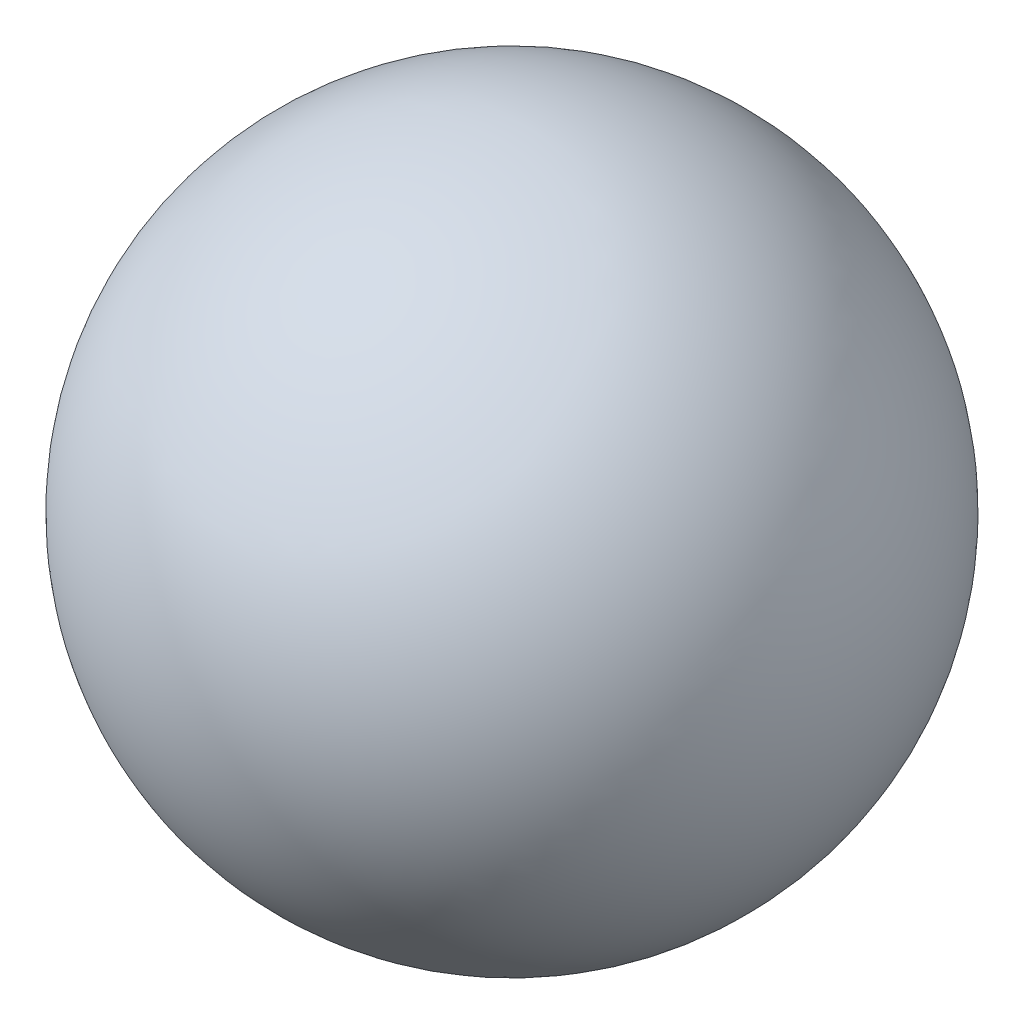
from build123d import *


with BuildPart() as part:
    # Sketch1 → Revolve1 (revolve)
    with BuildSketch(Plane(origin=(0, 0, 0), x_dir=(0, 0, -1), z_dir=(1, 0, 0))):
        with BuildLine():
            Line((1.5, 0), (-1.5, 0))
            ThreePointArc((-1.5, 0), (0, 1.5), (1.5, 0))
        make_face()
    revolve(axis=Axis((0, 0, 1.5), (0, 0, -1)))


solid = part.part
